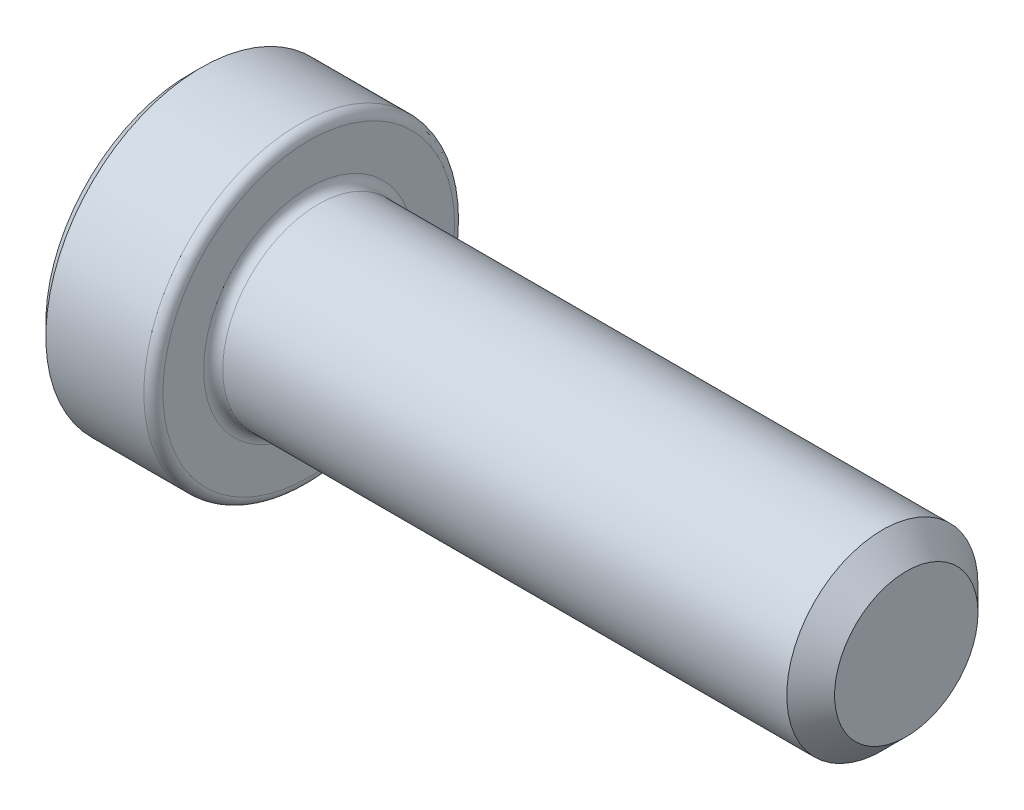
from build123d import *

# Parameters (mm, degrees)
SCHNITT_LINEAR_AUSTRAGEN1_DEPTH = 3
FASE2_SIZE                      = 2
FASE2_SIZE2                     = 1.154700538


with BuildPart() as part:
    # Skizze1 → Rotation1 (revolve)
    with BuildSketch(Plane(origin=(0, 0, 0), x_dir=(-1, 0, 0), z_dir=(0, 0, -1)), mode=Mode.PRIVATE) as rotation1_sk:
        with BuildLine():
            Line((30, 0), (30, 6))
            Line((30, 6), (29.5, 6.5))
            Line((29.5, 6.5), (25.4, 6.5))
            ThreePointArc((25.4, 6.5), (25.117157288, 6.382842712), (25, 6.1))
            Line((25, 6.1), (25, 4.4))
            ThreePointArc((25, 4.4), (24.882842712, 4.117157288), (24.6, 4))
            Line((24.6, 4), (1, 4))
            Line((1, 4), (0, 3))
            Line((0, 3), (0, 0))
            Line((0, 0), (30, 0))
        make_face()
    revolve(rotation1_sk.sketch.rotate(Axis((0, 0, 0), (-1, 0, 0)), 90), axis=Axis((0, 0, 0), (-1, 0, 0)))

    # Skizze2 → Schnitt-Linear austragen1 (cut)
    with BuildSketch(Plane.ZY.offset(30)):
        Polygon((-1.732050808, 3), (1.732050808, 3), (3.464101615, 0), (1.732050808, -3), (-1.732050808, -3), (-3.464101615, 0), align=None)
    extrude(amount=-SCHNITT_LINEAR_AUSTRAGEN1_DEPTH, mode=Mode.SUBTRACT)

    # Fase2
    fase2_edges = [part.edges().sort_by_distance(p)[0] for p in [
        (-27, 1.5, -2.598076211),
        (-27, 3, 0),
        (-27, 1.5, 2.598076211),
        (-27, -1.5, 2.598076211),
        (-27, -3, 0),
        (-27, -1.5, -2.598076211),
    ]]
    fase2_side = [part.faces().sort_by_distance(p)[0] for p in [
        (-27, 0, 0),
    ]]
    chamfer(fase2_edges, length=FASE2_SIZE, length2=FASE2_SIZE2, reference=fase2_side[0])


solid = part.part
